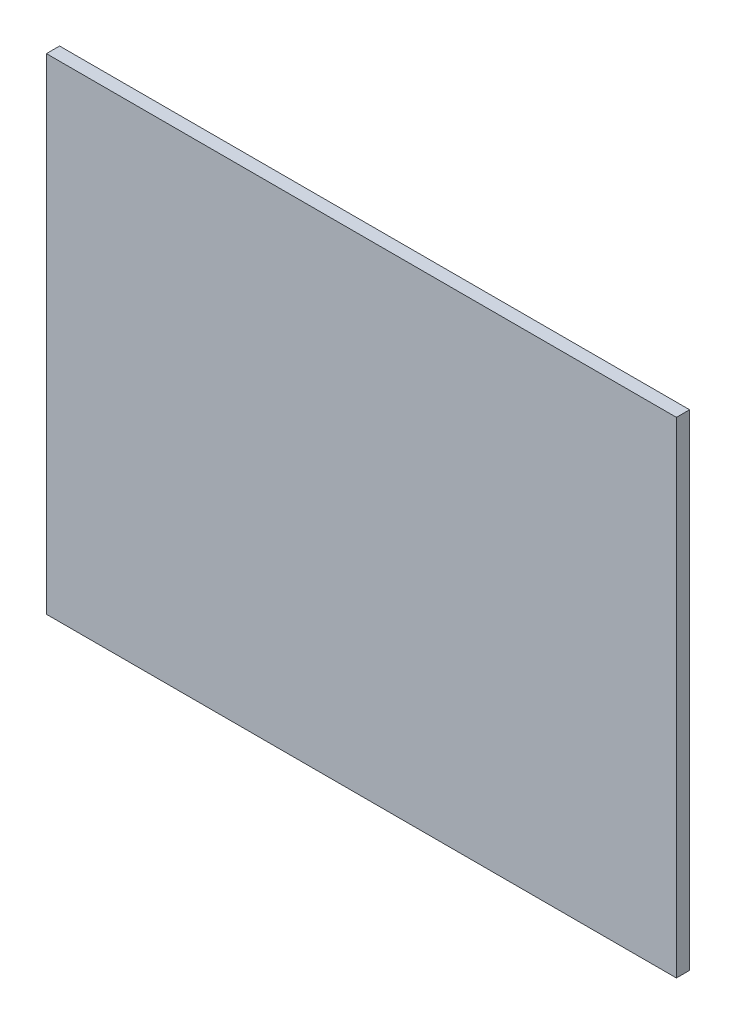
ISO-10303-21;
HEADER;
FILE_DESCRIPTION(('STEP AP214'),'2;1');
FILE_NAME('part.step','',(''),(''),'','','');
FILE_SCHEMA(('AUTOMOTIVE_DESIGN { 1 0 10303 214 1 1 1 1 }'));
ENDSEC;
DATA;
#1=APPLICATION_CONTEXT('core data for automotive mechanical design processes');
#2=APPLICATION_PROTOCOL_DEFINITION('international standard','automotive_design',2000,#1);
#3=PRODUCT_CONTEXT('',#1,'mechanical');
#4=PRODUCT('Part','Part','',(#3));
#5=PRODUCT_RELATED_PRODUCT_CATEGORY('part','',(#4));
#6=PRODUCT_DEFINITION_FORMATION('','',#4);
#7=PRODUCT_DEFINITION_CONTEXT('part definition',#1,'design');
#8=PRODUCT_DEFINITION('design','',#6,#7);
#9=PRODUCT_DEFINITION_SHAPE('','',#8);
#10=(LENGTH_UNIT() NAMED_UNIT(*) SI_UNIT(.MILLI.,.METRE.));
#11=(NAMED_UNIT(*) PLANE_ANGLE_UNIT() SI_UNIT($,.RADIAN.));
#12=(NAMED_UNIT(*) SI_UNIT($,.STERADIAN.) SOLID_ANGLE_UNIT());
#13=UNCERTAINTY_MEASURE_WITH_UNIT(LENGTH_MEASURE(1.E-05),#10,'distance_accuracy_value','');
#14=(GEOMETRIC_REPRESENTATION_CONTEXT(3) GLOBAL_UNCERTAINTY_ASSIGNED_CONTEXT((#13)) GLOBAL_UNIT_ASSIGNED_CONTEXT((#10,
#11,#12)) REPRESENTATION_CONTEXT('',''));
#15=CARTESIAN_POINT('',(0.,0.,0.));
#16=DIRECTION('',(0.,0.,1.));
#17=DIRECTION('',(1.,0.,0.));
#18=AXIS2_PLACEMENT_3D('',#15,#16,#17);
#19=CARTESIAN_POINT('',(0.,0.,10.));
#20=DIRECTION('',(1.,0.,0.));
#21=DIRECTION('',(0.,0.,-1.));
#22=AXIS2_PLACEMENT_3D('',#19,#20,#21);
#23=PLANE('',#22);
#24=DIRECTION('',(0.,-1.,0.));
#25=VECTOR('',#24,1.);
#26=CARTESIAN_POINT('',(0.,0.,0.));
#27=LINE('',#26,#25);
#28=CARTESIAN_POINT('',(0.,0.,0.));
#29=VERTEX_POINT('',#28);
#30=CARTESIAN_POINT('',(0.,-368.387134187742,0.));
#31=VERTEX_POINT('',#30);
#32=EDGE_CURVE('E94',#29,#31,#27,.T.);
#33=ORIENTED_EDGE('',*,*,#32,.T.);
#34=DIRECTION('',(0.,0.,-1.));
#35=VECTOR('',#34,1.);
#36=CARTESIAN_POINT('',(0.,-368.387134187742,10.));
#37=LINE('',#36,#35);
#38=CARTESIAN_POINT('',(0.,-368.387134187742,10.));
#39=VERTEX_POINT('',#38);
#40=EDGE_CURVE('E11',#39,#31,#37,.T.);
#41=ORIENTED_EDGE('',*,*,#40,.F.);
#42=DIRECTION('',(0.,-1.,0.));
#43=VECTOR('',#42,1.);
#44=CARTESIAN_POINT('',(0.,0.,10.));
#45=LINE('',#44,#43);
#46=CARTESIAN_POINT('',(0.,0.,10.));
#47=VERTEX_POINT('',#46);
#48=EDGE_CURVE('E82',#47,#39,#45,.T.);
#49=ORIENTED_EDGE('',*,*,#48,.F.);
#50=DIRECTION('',(0.,0.,-1.));
#51=VECTOR('',#50,1.);
#52=CARTESIAN_POINT('',(0.,0.,10.));
#53=LINE('',#52,#51);
#54=EDGE_CURVE('E90',#47,#29,#53,.T.);
#55=ORIENTED_EDGE('',*,*,#54,.T.);
#56=EDGE_LOOP('',(#33,#41,#49,#55));
#57=FACE_BOUND('',#56,.T.);
#58=ADVANCED_FACE('F31',(#57),#23,.F.);
#59=CARTESIAN_POINT('',(0.,-368.387134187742,10.));
#60=DIRECTION('',(0.,1.,0.));
#61=DIRECTION('',(0.,0.,1.));
#62=AXIS2_PLACEMENT_3D('',#59,#60,#61);
#63=PLANE('',#62);
#64=DIRECTION('',(1.,0.,0.));
#65=VECTOR('',#64,1.);
#66=CARTESIAN_POINT('',(0.,-368.387134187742,0.));
#67=LINE('',#66,#65);
#68=CARTESIAN_POINT('',(477.982124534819,-368.387134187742,0.));
#69=VERTEX_POINT('',#68);
#70=EDGE_CURVE('E86',#31,#69,#67,.T.);
#71=ORIENTED_EDGE('',*,*,#70,.T.);
#72=DIRECTION('',(0.,0.,-1.));
#73=VECTOR('',#72,1.);
#74=CARTESIAN_POINT('',(477.982124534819,-368.387134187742,10.));
#75=LINE('',#74,#73);
#76=CARTESIAN_POINT('',(477.982124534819,-368.387134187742,10.));
#77=VERTEX_POINT('',#76);
#78=EDGE_CURVE('E39',#77,#69,#75,.T.);
#79=ORIENTED_EDGE('',*,*,#78,.F.);
#80=DIRECTION('',(1.,0.,0.));
#81=VECTOR('',#80,1.);
#82=CARTESIAN_POINT('',(0.,-368.387134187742,10.));
#83=LINE('',#82,#81);
#84=EDGE_CURVE('E77',#39,#77,#83,.T.);
#85=ORIENTED_EDGE('',*,*,#84,.F.);
#86=ORIENTED_EDGE('',*,*,#40,.T.);
#87=EDGE_LOOP('',(#71,#79,#85,#86));
#88=FACE_BOUND('',#87,.T.);
#89=ADVANCED_FACE('F85',(#88),#63,.F.);
#90=CARTESIAN_POINT('',(477.982124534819,0.,10.));
#91=DIRECTION('',(-1.,0.,0.));
#92=DIRECTION('',(0.,-1.,0.));
#93=AXIS2_PLACEMENT_3D('',#90,#91,#92);
#94=PLANE('',#93);
#95=DIRECTION('',(0.,1.,0.));
#96=VECTOR('',#95,1.);
#97=CARTESIAN_POINT('',(477.982124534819,0.,0.));
#98=LINE('',#97,#96);
#99=CARTESIAN_POINT('',(477.982124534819,0.,0.));
#100=VERTEX_POINT('',#99);
#101=EDGE_CURVE('E64',#69,#100,#98,.T.);
#102=ORIENTED_EDGE('',*,*,#101,.T.);
#103=DIRECTION('',(0.,0.,-1.));
#104=VECTOR('',#103,1.);
#105=CARTESIAN_POINT('',(477.982124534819,0.,10.));
#106=LINE('',#105,#104);
#107=CARTESIAN_POINT('',(477.982124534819,0.,10.));
#108=VERTEX_POINT('',#107);
#109=EDGE_CURVE('E87',#108,#100,#106,.T.);
#110=ORIENTED_EDGE('',*,*,#109,.F.);
#111=DIRECTION('',(0.,1.,0.));
#112=VECTOR('',#111,1.);
#113=CARTESIAN_POINT('',(477.982124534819,0.,10.));
#114=LINE('',#113,#112);
#115=EDGE_CURVE('E80',#77,#108,#114,.T.);
#116=ORIENTED_EDGE('',*,*,#115,.F.);
#117=ORIENTED_EDGE('',*,*,#78,.T.);
#118=EDGE_LOOP('',(#102,#110,#116,#117));
#119=FACE_BOUND('',#118,.T.);
#120=ADVANCED_FACE('F88',(#119),#94,.F.);
#121=CARTESIAN_POINT('',(0.,0.,10.));
#122=DIRECTION('',(0.,-1.,0.));
#123=DIRECTION('',(0.,0.,-1.));
#124=AXIS2_PLACEMENT_3D('',#121,#122,#123);
#125=PLANE('',#124);
#126=DIRECTION('',(-1.,0.,0.));
#127=VECTOR('',#126,1.);
#128=CARTESIAN_POINT('',(0.,0.,0.));
#129=LINE('',#128,#127);
#130=EDGE_CURVE('E70',#100,#29,#129,.T.);
#131=ORIENTED_EDGE('',*,*,#130,.T.);
#132=ORIENTED_EDGE('',*,*,#54,.F.);
#133=DIRECTION('',(-1.,0.,0.));
#134=VECTOR('',#133,1.);
#135=CARTESIAN_POINT('',(0.,0.,10.));
#136=LINE('',#135,#134);
#137=EDGE_CURVE('E47',#108,#47,#136,.T.);
#138=ORIENTED_EDGE('',*,*,#137,.F.);
#139=ORIENTED_EDGE('',*,*,#109,.T.);
#140=EDGE_LOOP('',(#131,#132,#138,#139));
#141=FACE_BOUND('',#140,.T.);
#142=ADVANCED_FACE('F101',(#141),#125,.F.);
#143=CARTESIAN_POINT('',(0.,-368.387134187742,10.));
#144=DIRECTION('',(0.,0.,1.));
#145=DIRECTION('',(1.,0.,0.));
#146=AXIS2_PLACEMENT_3D('',#143,#144,#145);
#147=PLANE('',#146);
#148=ORIENTED_EDGE('',*,*,#48,.T.);
#149=ORIENTED_EDGE('',*,*,#84,.T.);
#150=ORIENTED_EDGE('',*,*,#115,.T.);
#151=ORIENTED_EDGE('',*,*,#137,.T.);
#152=EDGE_LOOP('',(#148,#149,#150,#151));
#153=FACE_BOUND('',#152,.T.);
#154=ADVANCED_FACE('F78',(#153),#147,.T.);
#155=CARTESIAN_POINT('',(0.,-368.387134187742,0.));
#156=DIRECTION('',(0.,0.,1.));
#157=DIRECTION('',(1.,0.,0.));
#158=AXIS2_PLACEMENT_3D('',#155,#156,#157);
#159=PLANE('',#158);
#160=ORIENTED_EDGE('',*,*,#32,.F.);
#161=ORIENTED_EDGE('',*,*,#130,.F.);
#162=ORIENTED_EDGE('',*,*,#101,.F.);
#163=ORIENTED_EDGE('',*,*,#70,.F.);
#164=EDGE_LOOP('',(#160,#161,#162,#163));
#165=FACE_BOUND('',#164,.T.);
#166=ADVANCED_FACE('F104',(#165),#159,.F.);
#167=CLOSED_SHELL('',(#58,#89,#120,#142,#154,#166));
#168=MANIFOLD_SOLID_BREP('B2',#167);
#169=ADVANCED_BREP_SHAPE_REPRESENTATION('',(#18,#168),#14);
#170=SHAPE_DEFINITION_REPRESENTATION(#9,#169);
ENDSEC;
END-ISO-10303-21;
